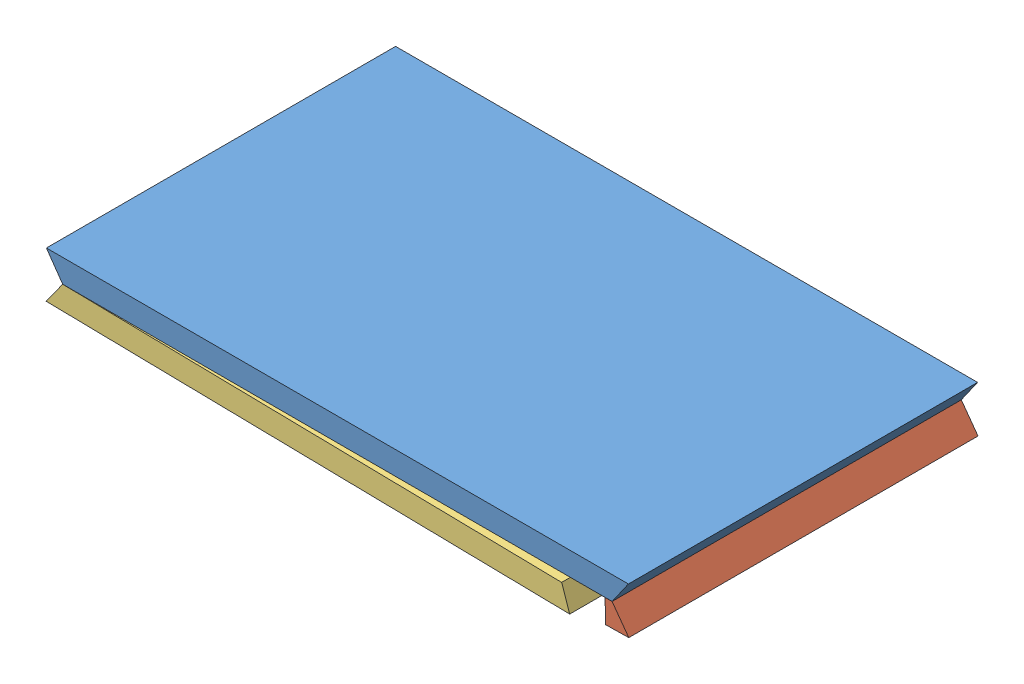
SolidWorks assembly Tabouret pliant - Bois et PMMA.SLDASM, configuration 1.Pliée (file format 5000). Lengths in mm.
Overall size (500.69 47.61 300).
3 component instances, 3 part files, 8 mates.
Components (placement in the parent):
- Plateau table-1: Plateau table.SLDPRT [Défaut] at origin size (500 20 300)
- Pied droit table-1: Pied droit table.SLDPRT [Défaut] at (-199.7591 -27.6077 60) x (0 0 -1) z (0.017452 -0.999848 0) size (300 450 20)
- Pied gauche table-1: Pied gauche table.SLDPRT [Défaut] at (-250.1724 -19.7541 -150) x (0 0 1) z (-0.017452 -0.999848 0) size (300 450 20)
Mates (geometry in assembly coordinates):
- Coïncidente1: coincident anti-aligned: line of Plateau table-1 through (235.9958 -10 -150) axis (0 0 1); line of Pied droit table-1 through (235.9958 -10 150) axis (0 0 -1)
- Coïncidente2: coincident aligned: plane of Plateau table-1 through (-250 10 150) normal (0 0 1); plane of Pied droit table-1 through (250.3469 -29.7525 150) normal (0 0 1)
- Coïncidente3: coincident anti-aligned: plane of Plateau table-1 through (250 10 -150.001) normal (0.819152 -0.573576 0); plane of Pied droit table-1
- Coïncidente4: coincident aligned: line of Plateau table-1 through (-235.9958 -10 -150) axis (0 0 1); line of Pied gauche table-1 through (-235.9958 -10 -150) axis (0 0 1)
- Coïncidente5: coincident aligned: plane of Plateau table-1 through (-250 10 -150) normal (0 0 -1); plane of Pied gauche table-1 through (199.5845 -37.6061 -150) normal (0 0 -1)
- Coïncidente6: coincident anti-aligned: plane of Plateau table-1 through (-250 10 -150.001) normal (-0.819152 -0.573576 0); plane of Pied gauche table-1
- Angle1: planar angle = 3.124139 rad aligned: plane of Plateau table-1 through (0 -10 0) normal (0 -1 0); plane of Pied gauche table-1 through (-249.9979 -9.7556 -150) normal (0.017452 0.999848 0)
- Angle2: planar angle = 3.124139 rad aligned: plane of Pied droit table-1 through (-199.9336 -17.6092 60) normal (-0.017452 0.999848 0); plane of Plateau table-1 through (0 -10 0) normal (0 -1 0)
